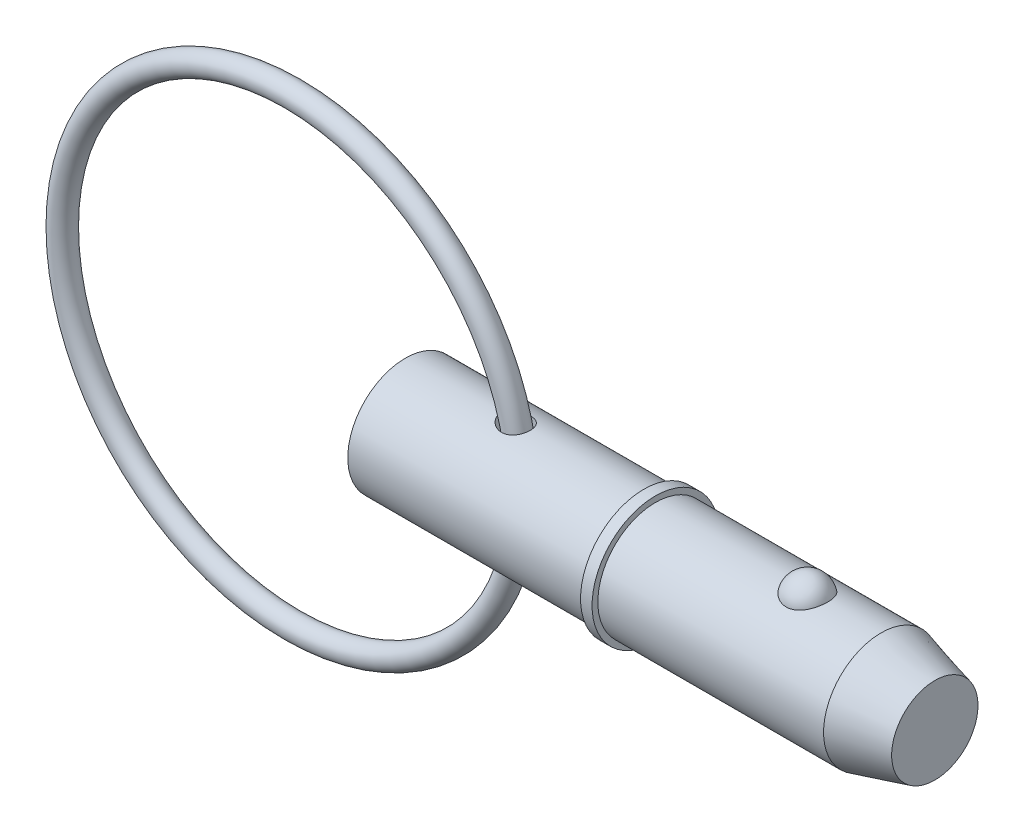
ISO-10303-21;
HEADER;
FILE_DESCRIPTION(('STEP AP214'),'2;1');
FILE_NAME('part.step','',(''),(''),'','','');
FILE_SCHEMA(('AUTOMOTIVE_DESIGN { 1 0 10303 214 1 1 1 1 }'));
ENDSEC;
DATA;
#1=APPLICATION_CONTEXT('core data for automotive mechanical design processes');
#2=APPLICATION_PROTOCOL_DEFINITION('international standard','automotive_design',2000,#1);
#3=PRODUCT_CONTEXT('',#1,'mechanical');
#4=PRODUCT('Part','Part','',(#3));
#5=PRODUCT_RELATED_PRODUCT_CATEGORY('part','',(#4));
#6=PRODUCT_DEFINITION_FORMATION('','',#4);
#7=PRODUCT_DEFINITION_CONTEXT('part definition',#1,'design');
#8=PRODUCT_DEFINITION('design','',#6,#7);
#9=PRODUCT_DEFINITION_SHAPE('','',#8);
#10=(LENGTH_UNIT() NAMED_UNIT(*) SI_UNIT(.MILLI.,.METRE.));
#11=(NAMED_UNIT(*) PLANE_ANGLE_UNIT() SI_UNIT($,.RADIAN.));
#12=(NAMED_UNIT(*) SI_UNIT($,.STERADIAN.) SOLID_ANGLE_UNIT());
#13=UNCERTAINTY_MEASURE_WITH_UNIT(LENGTH_MEASURE(1.E-05),#10,'distance_accuracy_value','');
#14=(GEOMETRIC_REPRESENTATION_CONTEXT(3) GLOBAL_UNCERTAINTY_ASSIGNED_CONTEXT((#13)) GLOBAL_UNIT_ASSIGNED_CONTEXT((#10,
#11,#12)) REPRESENTATION_CONTEXT('',''));
#15=CARTESIAN_POINT('',(0.,0.,0.));
#16=DIRECTION('',(0.,0.,1.));
#17=DIRECTION('',(1.,0.,0.));
#18=AXIS2_PLACEMENT_3D('',#15,#16,#17);
#19=CARTESIAN_POINT('',(-10.8860601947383,0.,0.));
#20=DIRECTION('',(0.,0.,1.));
#21=DIRECTION('',(1.,0.,0.));
#22=AXIS2_PLACEMENT_3D('',#19,#20,#21);
#23=TOROIDAL_SURFACE('',#22,22.225,1.111);
#24=CARTESIAN_POINT('',(12.4499398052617,0.,0.));
#25=VERTEX_POINT('',#24);
#26=VERTEX_LOOP('',#25);
#27=FACE_BOUND('',#26,.T.);
#28=ADVANCED_FACE('P0_F12',(#27),#23,.T.);
#29=CLOSED_SHELL('',(#28));
#30=MANIFOLD_SOLID_BREP('P0_B1',#29);
#31=CARTESIAN_POINT('',(0.,0.,0.));
#32=DIRECTION('',(1.,0.,0.));
#33=DIRECTION('',(0.,0.,-1.));
#34=AXIS2_PLACEMENT_3D('',#31,#32,#33);
#35=CYLINDRICAL_SURFACE('',#34,5.555);
#36=CARTESIAN_POINT('',(9.73108588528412,5.4531967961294,-1.05861687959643));
#37=CARTESIAN_POINT('',(9.79852417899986,5.4428857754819,-1.11173367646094));
#38=CARTESIAN_POINT('',(9.8705426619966,5.43287373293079,-1.15917228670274));
#39=CARTESIAN_POINT('',(10.0216706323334,5.41463354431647,-1.24159548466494));
#40=CARTESIAN_POINT('',(10.100788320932,5.40640749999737,-1.27656543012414));
#41=CARTESIAN_POINT('',(10.2640671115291,5.39277501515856,-1.33298568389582));
#42=CARTESIAN_POINT('',(10.3482338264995,5.38737178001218,-1.35442062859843));
#43=CARTESIAN_POINT('',(10.5191189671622,5.38018930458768,-1.38268153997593));
#44=CARTESIAN_POINT('',(10.6058357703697,5.37840780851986,-1.38951660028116));
#45=CARTESIAN_POINT('',(10.7759121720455,5.37883071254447,-1.38787777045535));
#46=CARTESIAN_POINT('',(10.8592768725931,5.38088957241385,-1.37996287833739));
#47=CARTESIAN_POINT('',(11.0231742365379,5.38856355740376,-1.34968531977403));
#48=CARTESIAN_POINT('',(11.1037078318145,5.39417750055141,-1.3273274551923));
#49=CARTESIAN_POINT('',(11.2542656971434,5.40784427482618,-1.27044672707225));
#50=CARTESIAN_POINT('',(11.3246325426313,5.41571997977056,-1.23678468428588));
#51=CARTESIAN_POINT('',(11.4584043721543,5.43310849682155,-1.15800564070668));
#52=CARTESIAN_POINT('',(11.5218100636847,5.4426211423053,-1.11288980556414));
#53=CARTESIAN_POINT('',(11.6387006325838,5.4619946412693,-1.01348173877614));
#54=CARTESIAN_POINT('',(11.6923567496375,5.47184490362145,-0.959388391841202));
#55=CARTESIAN_POINT('',(11.7899079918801,5.49098914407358,-0.842935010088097));
#56=CARTESIAN_POINT('',(11.8338027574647,5.50028310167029,-0.780574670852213));
#57=CARTESIAN_POINT('',(11.9111930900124,5.51740919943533,-0.64860577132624));
#58=CARTESIAN_POINT('',(11.944571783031,5.52522454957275,-0.578926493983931));
#59=CARTESIAN_POINT('',(11.9994972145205,5.53842713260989,-0.434834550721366));
#60=CARTESIAN_POINT('',(12.0210434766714,5.54381426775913,-0.360421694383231));
#61=CARTESIAN_POINT('',(12.0519313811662,5.55161917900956,-0.208311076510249));
#62=CARTESIAN_POINT('',(12.0611710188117,5.55401212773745,-0.130591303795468));
#63=CARTESIAN_POINT('',(12.0668974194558,5.55548938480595,0.0253480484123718));
#64=CARTESIAN_POINT('',(12.0633840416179,5.55457365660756,0.10356763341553));
#65=CARTESIAN_POINT('',(12.0436796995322,5.54953010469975,0.258343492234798));
#66=CARTESIAN_POINT('',(12.0274798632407,5.54540003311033,0.334898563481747));
#67=CARTESIAN_POINT('',(11.9827711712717,5.53437033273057,0.48411831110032));
#68=CARTESIAN_POINT('',(11.9542620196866,5.52747063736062,0.556782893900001));
#69=CARTESIAN_POINT('',(11.8856108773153,5.51165296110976,0.696153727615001));
#70=CARTESIAN_POINT('',(11.8454690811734,5.50273501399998,0.762860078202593));
#71=CARTESIAN_POINT('',(11.7545317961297,5.48386724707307,0.888403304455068));
#72=CARTESIAN_POINT('',(11.7037367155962,5.47391746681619,0.947240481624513));
#73=CARTESIAN_POINT('',(11.5931044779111,5.45416351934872,1.05504470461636));
#74=CARTESIAN_POINT('',(11.533318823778,5.44435885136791,1.10406448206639));
#75=CARTESIAN_POINT('',(11.4061321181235,5.42595363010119,1.19123649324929));
#76=CARTESIAN_POINT('',(11.3387321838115,5.41735290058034,1.22939031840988));
#77=CARTESIAN_POINT('',(11.1991395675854,5.4024225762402,1.29341737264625));
#78=CARTESIAN_POINT('',(11.1270175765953,5.39606585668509,1.3194385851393));
#79=CARTESIAN_POINT('',(10.979323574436,5.38614405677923,1.35937634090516));
#80=CARTESIAN_POINT('',(10.9037515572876,5.38257898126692,1.37329286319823));
#81=CARTESIAN_POINT('',(10.7507722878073,5.37854282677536,1.38901730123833));
#82=CARTESIAN_POINT('',(10.6733560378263,5.37809300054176,1.39074204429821));
#83=CARTESIAN_POINT('',(10.5192388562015,5.38029043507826,1.38221411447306));
#84=CARTESIAN_POINT('',(10.4425381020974,5.38293844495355,1.37195854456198));
#85=CARTESIAN_POINT('',(10.2878936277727,5.39116673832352,1.33926960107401));
#86=CARTESIAN_POINT('',(10.2100819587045,5.3968880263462,1.31624874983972));
#87=CARTESIAN_POINT('',(10.0591420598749,5.41064666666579,1.25849276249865));
#88=CARTESIAN_POINT('',(9.98601576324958,5.41868496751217,1.22375282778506));
#89=CARTESIAN_POINT('',(9.84175565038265,5.43675805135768,1.14087469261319));
#90=CARTESIAN_POINT('',(9.77103801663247,5.44688674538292,1.09202994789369));
#91=CARTESIAN_POINT('',(9.6388828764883,5.46759592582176,0.983100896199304));
#92=CARTESIAN_POINT('',(9.57744762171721,5.47817652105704,0.92301387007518));
#93=CARTESIAN_POINT('',(9.46620446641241,5.49850106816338,0.79298413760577));
#94=CARTESIAN_POINT('',(9.4163677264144,5.5082470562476,0.723066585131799));
#95=CARTESIAN_POINT('',(9.33050546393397,5.52566389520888,0.57497392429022));
#96=CARTESIAN_POINT('',(9.2944672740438,5.53333664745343,0.49680647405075));
#97=CARTESIAN_POINT('',(9.2410988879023,5.54491199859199,0.342579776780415));
#98=CARTESIAN_POINT('',(9.22228936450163,5.54910883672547,0.267055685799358));
#99=CARTESIAN_POINT('',(9.19883437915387,5.55436306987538,0.113748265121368));
#100=CARTESIAN_POINT('',(9.19417820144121,5.55542284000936,0.0359666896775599));
#101=CARTESIAN_POINT('',(9.19905385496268,5.55432298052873,-0.111477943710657));
#102=CARTESIAN_POINT('',(9.20724428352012,5.55246769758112,-0.181191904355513));
#103=CARTESIAN_POINT('',(9.23493000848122,5.54630180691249,-0.318223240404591));
#104=CARTESIAN_POINT('',(9.25442702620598,5.54199082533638,-0.385540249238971));
#105=CARTESIAN_POINT('',(9.30387481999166,5.5313474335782,-0.516280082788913));
#106=CARTESIAN_POINT('',(9.33386163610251,5.52500806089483,-0.579688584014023));
#107=CARTESIAN_POINT('',(9.40305503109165,5.51092599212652,-0.701037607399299));
#108=CARTESIAN_POINT('',(9.44225922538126,5.50318365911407,-0.758979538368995));
#109=CARTESIAN_POINT('',(9.52133732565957,5.48833949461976,-0.859230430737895));
#110=CARTESIAN_POINT('',(9.55998996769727,5.48134889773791,-0.90252975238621));
#111=CARTESIAN_POINT('',(9.64209346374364,5.46725903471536,-0.984288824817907));
#112=CARTESIAN_POINT('',(9.68554534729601,5.46015974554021,-1.02274753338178));
#113=CARTESIAN_POINT('',(9.73108588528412,5.4531967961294,-1.05861687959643));
#114=B_SPLINE_CURVE_WITH_KNOTS('',3,(#36,#37,#38,#39,#40,#41,#42,#43,#44,#45,#46,#47,#48,#49,
#50,#51,#52,#53,#54,#55,#56,#57,#58,#59,#60,#61,#62,#63,#64,#65,#66,#67,#68,#69,#70,#71,#72,#73,
#74,#75,#76,#77,#78,#79,#80,#81,#82,#83,#84,#85,#86,#87,#88,#89,#90,#91,#92,#93,#94,#95,#96,#97,
#98,#99,#100,#101,#102,#103,#104,#105,#106,#107,#108,#109,#110,#111,#112,#113),.UNSPECIFIED.,
.T.,.F.,(4,2,2,2,2,2,2,2,2,2,2,2,2,2,2,2,2,2,2,2,2,2,2,2,2,2,2,2,2,2,2,2,2,2,2,2,2,2,4),(0.,
0.259176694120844,0.518656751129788,0.778430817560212,1.03804303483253,1.28801585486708,
1.53790560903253,1.77195750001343,2.00598558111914,2.23539047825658,2.46480382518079,
2.69668356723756,2.9285726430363,3.16237203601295,3.39617401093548,3.63013963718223,
3.86411088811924,4.09807822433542,4.33203659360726,4.56470246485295,4.7973342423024,
5.02704913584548,5.25676442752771,5.48804534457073,5.71938220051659,5.96237360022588,
6.20546461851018,6.46387943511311,6.72235683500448,6.98018450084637,7.23777490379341,
7.47029684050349,7.70264268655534,7.91229396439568,8.12197716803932,8.33238797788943,
8.54274441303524,8.71772674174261,8.89274668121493),.UNSPECIFIED.);
#115=CARTESIAN_POINT('',(9.73108588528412,5.4531967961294,-1.05861687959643));
#116=VERTEX_POINT('',#115);
#117=EDGE_CURVE('P1_E42',#116,#116,#114,.T.);
#118=ORIENTED_EDGE('',*,*,#117,.T.);
#119=EDGE_LOOP('',(#118));
#120=FACE_BOUND('',#119,.T.);
#121=CARTESIAN_POINT('',(0.,0.,0.));
#122=DIRECTION('',(1.,0.,0.));
#123=DIRECTION('',(0.,0.,-1.));
#124=AXIS2_PLACEMENT_3D('',#121,#122,#123);
#125=CIRCLE('',#124,5.555);
#126=CARTESIAN_POINT('',(0.,0.,-5.555));
#127=VERTEX_POINT('',#126);
#128=EDGE_CURVE('P1_E9',#127,#127,#125,.T.);
#129=ORIENTED_EDGE('',*,*,#128,.T.);
#130=EDGE_LOOP('',(#129));
#131=FACE_BOUND('',#130,.T.);
#132=CARTESIAN_POINT('',(23.019,0.,0.));
#133=DIRECTION('',(1.,0.,0.));
#134=DIRECTION('',(0.,0.,-1.));
#135=AXIS2_PLACEMENT_3D('',#132,#133,#134);
#136=CIRCLE('',#135,5.555);
#137=CARTESIAN_POINT('',(23.019,0.,-5.555));
#138=VERTEX_POINT('',#137);
#139=EDGE_CURVE('P1_E25',#138,#138,#136,.T.);
#140=ORIENTED_EDGE('',*,*,#139,.F.);
#141=EDGE_LOOP('',(#140));
#142=FACE_BOUND('',#141,.T.);
#143=CARTESIAN_POINT('',(9.73108588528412,-5.4531967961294,-1.05861687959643));
#144=CARTESIAN_POINT('',(9.66821110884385,-5.46281068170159,-1.00909184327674));
#145=CARTESIAN_POINT('',(9.60927221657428,-5.47269103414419,-0.954597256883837));
#146=CARTESIAN_POINT('',(9.50103698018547,-5.49196271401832,-0.836622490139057));
#147=CARTESIAN_POINT('',(9.45174193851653,-5.50135397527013,-0.77314109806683));
#148=CARTESIAN_POINT('',(9.36449982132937,-5.51864538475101,-0.638139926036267));
#149=CARTESIAN_POINT('',(9.32660692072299,-5.52653835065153,-0.566583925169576));
#150=CARTESIAN_POINT('',(9.26443740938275,-5.53978685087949,-0.417563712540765));
#151=CARTESIAN_POINT('',(9.24015003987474,-5.54514438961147,-0.34010422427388));
#152=CARTESIAN_POINT('',(9.20806696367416,-5.55228040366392,-0.18838925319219));
#153=CARTESIAN_POINT('',(9.19907227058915,-5.55431849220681,-0.114399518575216));
#154=CARTESIAN_POINT('',(9.19432225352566,-5.55539069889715,0.0340148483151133));
#155=CARTESIAN_POINT('',(9.19856204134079,-5.55442592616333,0.108439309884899));
#156=CARTESIAN_POINT('',(9.21926816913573,-5.54978420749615,0.250226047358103));
#157=CARTESIAN_POINT('',(9.2348766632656,-5.54629766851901,0.31772275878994));
#158=CARTESIAN_POINT('',(9.27656619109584,-5.53719805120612,0.449233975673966));
#159=CARTESIAN_POINT('',(9.3026486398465,-5.53158468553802,0.513248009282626));
#160=CARTESIAN_POINT('',(9.36540111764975,-5.51852259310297,0.63880901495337));
#161=CARTESIAN_POINT('',(9.40244578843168,-5.51101059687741,0.700161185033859));
#162=CARTESIAN_POINT('',(9.48531033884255,-5.49498546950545,0.816463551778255));
#163=CARTESIAN_POINT('',(9.5311337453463,-5.48647193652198,0.871411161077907));
#164=CARTESIAN_POINT('',(9.63549825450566,-5.46826315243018,0.979510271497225));
#165=CARTESIAN_POINT('',(9.69487291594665,-5.4585383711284,1.03185240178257));
#166=CARTESIAN_POINT('',(9.82107706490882,-5.43973797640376,1.12677509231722));
#167=CARTESIAN_POINT('',(9.8879103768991,-5.43066269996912,1.16935061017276));
#168=CARTESIAN_POINT('',(10.033391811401,-5.41336505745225,1.24708757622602));
#169=CARTESIAN_POINT('',(10.1125613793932,-5.40528106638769,1.28130933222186));
#170=CARTESIAN_POINT('',(10.2757060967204,-5.39196874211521,1.3362270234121));
#171=CARTESIAN_POINT('',(10.3596813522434,-5.38674047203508,1.35692265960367));
#172=CARTESIAN_POINT('',(10.5297702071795,-5.37991196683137,1.38375156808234));
#173=CARTESIAN_POINT('',(10.6158742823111,-5.37829778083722,1.38994084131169));
#174=CARTESIAN_POINT('',(10.7878226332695,-5.3790107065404,1.38718250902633));
#175=CARTESIAN_POINT('',(10.8736670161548,-5.38133587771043,1.37824235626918));
#176=CARTESIAN_POINT('',(11.0366214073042,-5.38945418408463,1.34612618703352));
#177=CARTESIAN_POINT('',(11.1139351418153,-5.39501006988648,1.32392147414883));
#178=CARTESIAN_POINT('',(11.2633246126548,-5.40877222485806,1.26652021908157));
#179=CARTESIAN_POINT('',(11.3354015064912,-5.4169779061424,1.23132655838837));
#180=CARTESIAN_POINT('',(11.4690899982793,-5.43466078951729,1.15069817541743));
#181=CARTESIAN_POINT('',(11.5310200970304,-5.4440673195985,1.10577441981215));
#182=CARTESIAN_POINT('',(11.6463540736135,-5.46335537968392,1.0061512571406));
#183=CARTESIAN_POINT('',(11.6997580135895,-5.47323690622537,0.951451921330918));
#184=CARTESIAN_POINT('',(11.7967319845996,-5.49239864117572,0.833747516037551));
#185=CARTESIAN_POINT('',(11.8402908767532,-5.50167816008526,0.770733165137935));
#186=CARTESIAN_POINT('',(11.9164538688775,-5.518621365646,0.638202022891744));
#187=CARTESIAN_POINT('',(11.9490573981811,-5.52628496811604,0.568684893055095));
#188=CARTESIAN_POINT('',(12.0028717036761,-5.53925911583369,0.424207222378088));
#189=CARTESIAN_POINT('',(12.023941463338,-5.54454040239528,0.349191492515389));
#190=CARTESIAN_POINT('',(12.053591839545,-5.55204602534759,0.196582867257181));
#191=CARTESIAN_POINT('',(12.0621722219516,-5.55427030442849,0.118989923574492));
#192=CARTESIAN_POINT('',(12.0666512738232,-5.55542602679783,-0.0368468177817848));
#193=CARTESIAN_POINT('',(12.0625074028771,-5.55434642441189,-0.115091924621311));
#194=CARTESIAN_POINT('',(12.0415418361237,-5.54898613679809,-0.269753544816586));
#195=CARTESIAN_POINT('',(12.0247199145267,-5.54470539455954,-0.346170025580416));
#196=CARTESIAN_POINT('',(11.9787920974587,-5.53340452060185,-0.495008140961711));
#197=CARTESIAN_POINT('',(11.9496857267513,-5.52638428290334,-0.56742962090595));
#198=CARTESIAN_POINT('',(11.8798787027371,-5.51036911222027,-0.706216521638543));
#199=CARTESIAN_POINT('',(11.8391779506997,-5.50137416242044,-0.772581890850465));
#200=CARTESIAN_POINT('',(11.7472553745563,-5.48242167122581,-0.89724716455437));
#201=CARTESIAN_POINT('',(11.6960515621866,-5.47246579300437,-0.955560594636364));
#202=CARTESIAN_POINT('',(11.5843994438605,-5.45270071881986,-1.06256643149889));
#203=CARTESIAN_POINT('',(11.5239521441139,-5.44289150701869,-1.11125988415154));
#204=CARTESIAN_POINT('',(11.396157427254,-5.42463941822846,-1.19717500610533));
#205=CARTESIAN_POINT('',(11.3288903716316,-5.41618309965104,-1.23451335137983));
#206=CARTESIAN_POINT('',(11.1888557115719,-5.40145691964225,-1.29743539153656));
#207=CARTESIAN_POINT('',(11.1160887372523,-5.39518680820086,-1.32302043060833));
#208=CARTESIAN_POINT('',(10.9677009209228,-5.38553131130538,-1.36179181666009));
#209=CARTESIAN_POINT('',(10.8921036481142,-5.3821260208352,-1.3750637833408));
#210=CARTESIAN_POINT('',(10.7396925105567,-5.37842027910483,-1.38948741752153));
#211=CARTESIAN_POINT('',(10.6628784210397,-5.37812040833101,-1.39063681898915));
#212=CARTESIAN_POINT('',(10.5077947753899,-5.38059635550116,-1.38102577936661));
#213=CARTESIAN_POINT('',(10.4295489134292,-5.3834629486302,-1.36991384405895));
#214=CARTESIAN_POINT('',(10.2758428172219,-5.3920092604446,-1.33587599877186));
#215=CARTESIAN_POINT('',(10.2003829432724,-5.39768934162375,-1.3129485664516));
#216=CARTESIAN_POINT('',(10.0559381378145,-5.41102817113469,-1.25682313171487));
#217=CARTESIAN_POINT('',(9.98683368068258,-5.41862962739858,-1.22391777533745));
#218=CARTESIAN_POINT('',(9.85432617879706,-5.43513913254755,-1.14838146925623));
#219=CARTESIAN_POINT('',(9.79092361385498,-5.44404729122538,-1.1057497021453));
#220=CARTESIAN_POINT('',(9.73108588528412,-5.4531967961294,-1.05861687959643));
#221=B_SPLINE_CURVE_WITH_KNOTS('',3,(#143,#144,#145,#146,#147,#148,#149,#150,#151,#152,#153,
#154,#155,#156,#157,#158,#159,#160,#161,#162,#163,#164,#165,#166,#167,#168,#169,#170,#171,#172,
#173,#174,#175,#176,#177,#178,#179,#180,#181,#182,#183,#184,#185,#186,#187,#188,#189,#190,#191,
#192,#193,#194,#195,#196,#197,#198,#199,#200,#201,#202,#203,#204,#205,#206,#207,#208,#209,#210,
#211,#212,#213,#214,#215,#216,#217,#218,#219,#220),.UNSPECIFIED.,.T.,.F.,(4,2,2,2,2,2,2,2,2,2,2,
2,2,2,2,2,2,2,2,2,2,2,2,2,2,2,2,2,2,2,2,2,2,2,2,2,2,2,4),(0.,0.241596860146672,
0.483226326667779,0.725986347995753,0.968554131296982,1.19103755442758,1.41343881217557,
1.62059806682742,1.82778531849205,2.04308674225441,2.25847484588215,2.4967195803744,
2.73508704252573,2.99374644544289,3.25241156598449,3.51007646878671,3.76761448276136,
4.00827541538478,4.24888299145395,4.47904430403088,4.70920393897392,4.93962269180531,
5.17005344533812,5.4032419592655,5.63643484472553,5.87040820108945,6.10438572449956,
6.33837230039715,6.57236086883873,6.80595147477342,7.03951667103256,7.27059385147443,
7.50164459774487,7.73107640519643,7.96055109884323,8.19677907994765,8.43303750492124,
8.66294515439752,8.8928721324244),.UNSPECIFIED.);
#222=CARTESIAN_POINT('',(9.73108588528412,-5.4531967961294,-1.05861687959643));
#223=VERTEX_POINT('',#222);
#224=EDGE_CURVE('P1_E17',#223,#223,#221,.T.);
#225=ORIENTED_EDGE('',*,*,#224,.T.);
#226=EDGE_LOOP('',(#225));
#227=FACE_BOUND('',#226,.T.);
#228=ADVANCED_FACE('P1_F13',(#120,#131,#142,#227),#35,.T.);
#229=CARTESIAN_POINT('',(0.,0.,0.));
#230=DIRECTION('',(1.,0.,0.));
#231=DIRECTION('',(0.,0.,-1.));
#232=AXIS2_PLACEMENT_3D('',#229,#230,#231);
#233=CYLINDRICAL_SURFACE('',#232,5.555);
#234=CARTESIAN_POINT('',(45.9171144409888,0.,0.));
#235=DIRECTION('',(1.,0.,0.));
#236=DIRECTION('',(0.,0.,-1.));
#237=AXIS2_PLACEMENT_3D('',#234,#235,#236);
#238=CIRCLE('',#237,5.555);
#239=CARTESIAN_POINT('',(45.9171144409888,0.,-5.555));
#240=VERTEX_POINT('',#239);
#241=EDGE_CURVE('P1_E99',#240,#240,#238,.T.);
#242=ORIENTED_EDGE('',*,*,#241,.F.);
#243=EDGE_LOOP('',(#242));
#244=FACE_BOUND('',#243,.T.);
#245=CARTESIAN_POINT('',(24.13,0.,0.));
#246=DIRECTION('',(1.,0.,0.));
#247=DIRECTION('',(0.,0.,-1.));
#248=AXIS2_PLACEMENT_3D('',#245,#246,#247);
#249=CIRCLE('',#248,5.555);
#250=CARTESIAN_POINT('',(24.13,0.,-5.555));
#251=VERTEX_POINT('',#250);
#252=EDGE_CURVE('P1_E96',#251,#251,#249,.T.);
#253=ORIENTED_EDGE('',*,*,#252,.T.);
#254=EDGE_LOOP('',(#253));
#255=FACE_BOUND('',#254,.T.);
#256=CARTESIAN_POINT('',(38.7986264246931,5.16741224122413,2.03859650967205));
#257=CARTESIAN_POINT('',(38.6929492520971,5.16740893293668,2.03859990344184));
#258=CARTESIAN_POINT('',(38.58729894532,5.17079470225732,2.03008306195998));
#259=CARTESIAN_POINT('',(38.3791419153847,5.18392795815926,1.9963072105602));
#260=CARTESIAN_POINT('',(38.2766344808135,5.19367399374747,1.9710520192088));
#261=CARTESIAN_POINT('',(38.0777710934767,5.21839168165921,1.90463997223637));
#262=CARTESIAN_POINT('',(37.9814064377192,5.23335573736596,1.86350622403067));
#263=CARTESIAN_POINT('',(37.7970804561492,5.26688076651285,1.76652592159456));
#264=CARTESIAN_POINT('',(37.7091207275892,5.28544242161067,1.71067657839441));
#265=CARTESIAN_POINT('',(37.5412654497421,5.32479845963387,1.58399959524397));
#266=CARTESIAN_POINT('',(37.4616656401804,5.34564089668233,1.51279545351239));
#267=CARTESIAN_POINT('',(37.3151290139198,5.38697258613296,1.35828584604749));
#268=CARTESIAN_POINT('',(37.248194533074,5.40746177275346,1.27497815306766));
#269=CARTESIAN_POINT('',(37.1256103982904,5.44694508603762,1.09440293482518));
#270=CARTESIAN_POINT('',(37.0705989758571,5.46583143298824,0.99667783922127));
#271=CARTESIAN_POINT('',(36.9769376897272,5.49908030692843,0.792961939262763));
#272=CARTESIAN_POINT('',(36.9382894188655,5.513442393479,0.686970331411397));
#273=CARTESIAN_POINT('',(36.8776807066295,5.536358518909,0.468019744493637));
#274=CARTESIAN_POINT('',(36.8559725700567,5.54482455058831,0.35498154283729));
#275=CARTESIAN_POINT('',(36.8306362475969,5.55473324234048,0.126595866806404));
#276=CARTESIAN_POINT('',(36.8270077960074,5.55617600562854,0.0112484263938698));
#277=CARTESIAN_POINT('',(36.8378817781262,5.55189984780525,-0.21801161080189));
#278=CARTESIAN_POINT('',(36.8523151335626,5.54620821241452,-0.331928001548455));
#279=CARTESIAN_POINT('',(36.8989034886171,5.52828920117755,-0.555544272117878));
#280=CARTESIAN_POINT('',(36.9310588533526,5.51606169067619,-0.665244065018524));
#281=CARTESIAN_POINT('',(37.0124883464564,5.48630779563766,-0.877469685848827));
#282=CARTESIAN_POINT('',(37.0617816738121,5.4687754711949,-0.979987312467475));
#283=CARTESIAN_POINT('',(37.1764785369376,5.43024700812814,-1.1748697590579));
#284=CARTESIAN_POINT('',(37.2418831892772,5.4092506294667,-1.26723387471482));
#285=CARTESIAN_POINT('',(37.3875712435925,5.36600927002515,-1.4394013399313));
#286=CARTESIAN_POINT('',(37.4678859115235,5.34376173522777,-1.51917763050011));
#287=CARTESIAN_POINT('',(37.6414520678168,5.30057971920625,-1.6636033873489));
#288=CARTESIAN_POINT('',(37.734702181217,5.27964509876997,-1.72825445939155));
#289=CARTESIAN_POINT('',(37.9293939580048,5.24205250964,-1.8390947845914));
#290=CARTESIAN_POINT('',(38.0305900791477,5.22530519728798,-1.88568407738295));
#291=CARTESIAN_POINT('',(38.2401552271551,5.19750919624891,-1.96100802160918));
#292=CARTESIAN_POINT('',(38.3485215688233,5.1864583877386,-1.98974931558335));
#293=CARTESIAN_POINT('',(38.5634989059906,5.17184410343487,-2.02742262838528));
#294=CARTESIAN_POINT('',(38.669925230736,5.16793282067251,-2.0372760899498));
#295=CARTESIAN_POINT('',(38.8829925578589,5.1669899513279,-2.03966777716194));
#296=CARTESIAN_POINT('',(38.9896335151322,5.16995704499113,-2.03220932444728));
#297=CARTESIAN_POINT('',(39.1967730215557,5.18222383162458,-2.0007117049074));
#298=CARTESIAN_POINT('',(39.2973599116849,5.19133213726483,-1.97717337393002));
#299=CARTESIAN_POINT('',(39.4930141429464,5.21467637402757,-1.91475248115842));
#300=CARTESIAN_POINT('',(39.5880810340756,5.22891272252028,-1.87586867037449));
#301=CARTESIAN_POINT('',(39.7723711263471,5.26137066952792,-1.78282713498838));
#302=CARTESIAN_POINT('',(39.8614190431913,5.27967329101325,-1.7283512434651));
#303=CARTESIAN_POINT('',(40.0292880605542,5.31817411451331,-1.60597483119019));
#304=CARTESIAN_POINT('',(40.1081068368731,5.33837274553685,-1.53807126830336));
#305=CARTESIAN_POINT('',(40.2575156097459,5.37968287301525,-1.38688970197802));
#306=CARTESIAN_POINT('',(40.3275058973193,5.40079011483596,-1.30301744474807));
#307=CARTESIAN_POINT('',(40.4530125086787,5.44074401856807,-1.12458170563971));
#308=CARTESIAN_POINT('',(40.5085262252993,5.4595902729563,-1.03001630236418));
#309=CARTESIAN_POINT('',(40.6055507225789,5.49369849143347,-0.829439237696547));
#310=CARTESIAN_POINT('',(40.6465483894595,5.50882422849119,-0.723155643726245));
#311=CARTESIAN_POINT('',(40.7111250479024,5.53310911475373,-0.504772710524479));
#312=CARTESIAN_POINT('',(40.7347036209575,5.54226812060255,-0.392673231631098));
#313=CARTESIAN_POINT('',(40.764013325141,5.55370358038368,-0.165459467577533));
#314=CARTESIAN_POINT('',(40.7696884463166,5.55595843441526,-0.0503368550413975));
#315=CARTESIAN_POINT('',(40.762916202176,5.55329317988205,0.179288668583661));
#316=CARTESIAN_POINT('',(40.7504690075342,5.54837313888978,0.293791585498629));
#317=CARTESIAN_POINT('',(40.7077798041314,5.53189037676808,0.518526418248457));
#318=CARTESIAN_POINT('',(40.677598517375,5.5203503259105,0.628771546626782));
#319=CARTESIAN_POINT('',(40.6000962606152,5.49182453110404,0.842318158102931));
#320=CARTESIAN_POINT('',(40.5527743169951,5.47483847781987,0.945619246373));
#321=CARTESIAN_POINT('',(40.4417204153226,5.43710633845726,1.14281571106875));
#322=CARTESIAN_POINT('',(40.377921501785,5.41634501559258,1.23667048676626));
#323=CARTESIAN_POINT('',(40.2353577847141,5.37334572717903,1.41185243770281));
#324=CARTESIAN_POINT('',(40.1565932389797,5.35110778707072,1.49317982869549));
#325=CARTESIAN_POINT('',(39.9864234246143,5.30779474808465,1.64049162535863));
#326=CARTESIAN_POINT('',(39.8951002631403,5.28671324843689,1.7065687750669));
#327=CARTESIAN_POINT('',(39.7017390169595,5.24804852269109,1.82201372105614));
#328=CARTESIAN_POINT('',(39.5997005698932,5.23046541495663,1.87138095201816));
#329=CARTESIAN_POINT('',(39.3836187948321,5.20042692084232,1.95335298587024));
#330=CARTESIAN_POINT('',(39.2692602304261,5.18820192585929,1.98521734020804));
#331=CARTESIAN_POINT('',(39.0361307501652,5.17169804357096,2.02783294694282));
#332=CARTESIAN_POINT('',(38.9173616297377,5.16741595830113,2.03859269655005));
#333=CARTESIAN_POINT('',(38.7986264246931,5.16741224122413,2.03859650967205));
#334=B_SPLINE_CURVE_WITH_KNOTS('',3,(#256,#257,#258,#259,#260,#261,#262,#263,#264,#265,#266,
#267,#268,#269,#270,#271,#272,#273,#274,#275,#276,#277,#278,#279,#280,#281,#282,#283,#284,#285,
#286,#287,#288,#289,#290,#291,#292,#293,#294,#295,#296,#297,#298,#299,#300,#301,#302,#303,#304,
#305,#306,#307,#308,#309,#310,#311,#312,#313,#314,#315,#316,#317,#318,#319,#320,#321,#322,#323,
#324,#325,#326,#327,#328,#329,#330,#331,#332,#333),.UNSPECIFIED.,.T.,.F.,(4,2,2,2,2,2,2,2,2,2,2,
2,2,2,2,2,2,2,2,2,2,2,2,2,2,2,2,2,2,2,2,2,2,2,2,2,2,2,4),(0.,0.316595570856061,
0.633118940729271,0.949183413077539,1.26530783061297,1.59030762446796,1.91536729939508,
2.25495824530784,2.59458224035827,2.93917283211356,3.28375835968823,3.62703002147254,
3.97030875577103,4.31397329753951,4.65766166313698,5.00207904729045,5.34645984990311,
5.6827054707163,6.0188258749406,6.33808403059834,6.65728093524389,6.9669637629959,
7.27667180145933,7.59321535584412,7.90983070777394,8.24210387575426,8.57443684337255,
8.91755896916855,9.26068933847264,9.60489211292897,9.94909164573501,10.2921194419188,
10.6351667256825,10.9796305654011,11.324088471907,11.666392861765,12.0087088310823,
12.3645679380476,12.7202837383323),.UNSPECIFIED.);
#335=CARTESIAN_POINT('',(38.7986264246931,5.16741224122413,2.03859650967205));
#336=VERTEX_POINT('',#335);
#337=EDGE_CURVE('P1_E34',#336,#336,#334,.T.);
#338=ORIENTED_EDGE('',*,*,#337,.T.);
#339=EDGE_LOOP('',(#338));
#340=FACE_BOUND('',#339,.T.);
#341=ADVANCED_FACE('P1_F46',(#244,#255,#340),#233,.T.);
#342=CARTESIAN_POINT('',(0.,0.,0.));
#343=DIRECTION('',(-1.,0.,0.));
#344=DIRECTION('',(0.,0.,1.));
#345=AXIS2_PLACEMENT_3D('',#342,#343,#344);
#346=PLANE('',#345);
#347=ORIENTED_EDGE('',*,*,#128,.F.);
#348=EDGE_LOOP('',(#347));
#349=FACE_BOUND('',#348,.T.);
#350=ADVANCED_FACE('P1_F15',(#349),#346,.T.);
#351=CARTESIAN_POINT('',(23.019,5.555,0.));
#352=DIRECTION('',(-1.,0.,0.));
#353=DIRECTION('',(0.,0.,1.));
#354=AXIS2_PLACEMENT_3D('',#351,#352,#353);
#355=PLANE('',#354);
#356=ORIENTED_EDGE('',*,*,#139,.T.);
#357=EDGE_LOOP('',(#356));
#358=FACE_BOUND('',#357,.T.);
#359=CARTESIAN_POINT('',(23.019,0.,0.));
#360=DIRECTION('',(1.,0.,0.));
#361=DIRECTION('',(0.,0.,-1.));
#362=AXIS2_PLACEMENT_3D('',#359,#360,#361);
#363=CIRCLE('',#362,6.1105);
#364=CARTESIAN_POINT('',(23.019,0.,-6.1105));
#365=VERTEX_POINT('',#364);
#366=EDGE_CURVE('P1_E30',#365,#365,#363,.T.);
#367=ORIENTED_EDGE('',*,*,#366,.F.);
#368=EDGE_LOOP('',(#367));
#369=FACE_BOUND('',#368,.T.);
#370=ADVANCED_FACE('P1_F81',(#358,#369),#355,.T.);
#371=CARTESIAN_POINT('',(0.,0.,0.));
#372=DIRECTION('',(1.,0.,0.));
#373=DIRECTION('',(0.,0.,-1.));
#374=AXIS2_PLACEMENT_3D('',#371,#372,#373);
#375=CYLINDRICAL_SURFACE('',#374,6.1105);
#376=ORIENTED_EDGE('',*,*,#366,.T.);
#377=EDGE_LOOP('',(#376));
#378=FACE_BOUND('',#377,.T.);
#379=CARTESIAN_POINT('',(24.13,0.,0.));
#380=DIRECTION('',(1.,0.,0.));
#381=DIRECTION('',(0.,0.,-1.));
#382=AXIS2_PLACEMENT_3D('',#379,#380,#381);
#383=CIRCLE('',#382,6.1105);
#384=CARTESIAN_POINT('',(24.13,0.,-6.1105));
#385=VERTEX_POINT('',#384);
#386=EDGE_CURVE('P1_E95',#385,#385,#383,.T.);
#387=ORIENTED_EDGE('',*,*,#386,.F.);
#388=EDGE_LOOP('',(#387));
#389=FACE_BOUND('',#388,.T.);
#390=ADVANCED_FACE('P1_F68',(#378,#389),#375,.T.);
#391=CARTESIAN_POINT('',(24.13,6.1105,0.));
#392=DIRECTION('',(1.,0.,0.));
#393=DIRECTION('',(0.,0.,-1.));
#394=AXIS2_PLACEMENT_3D('',#391,#392,#393);
#395=PLANE('',#394);
#396=ORIENTED_EDGE('',*,*,#386,.T.);
#397=EDGE_LOOP('',(#396));
#398=FACE_BOUND('',#397,.T.);
#399=ORIENTED_EDGE('',*,*,#252,.F.);
#400=EDGE_LOOP('',(#399));
#401=FACE_BOUND('',#400,.T.);
#402=ADVANCED_FACE('P1_F62',(#398,#401),#395,.T.);
#403=CARTESIAN_POINT('',(51.1,0.,0.));
#404=DIRECTION('',(-1.,0.,0.));
#405=DIRECTION('',(0.,0.,1.));
#406=AXIS2_PLACEMENT_3D('',#403,#404,#405);
#407=CONICAL_SURFACE('',#406,4.16625000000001,0.26179938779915);
#408=ORIENTED_EDGE('',*,*,#241,.T.);
#409=EDGE_LOOP('',(#408));
#410=FACE_BOUND('',#409,.T.);
#411=CARTESIAN_POINT('',(51.1,0.,0.));
#412=DIRECTION('',(1.,0.,0.));
#413=DIRECTION('',(0.,0.,-1.));
#414=AXIS2_PLACEMENT_3D('',#411,#412,#413);
#415=CIRCLE('',#414,4.16625000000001);
#416=CARTESIAN_POINT('',(51.1,0.,-4.16625000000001));
#417=VERTEX_POINT('',#416);
#418=EDGE_CURVE('P1_E41',#417,#417,#415,.T.);
#419=ORIENTED_EDGE('',*,*,#418,.F.);
#420=EDGE_LOOP('',(#419));
#421=FACE_BOUND('',#420,.T.);
#422=ADVANCED_FACE('P1_F59',(#410,#421),#407,.T.);
#423=CARTESIAN_POINT('',(51.1,4.16625000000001,0.));
#424=DIRECTION('',(1.,0.,0.));
#425=DIRECTION('',(0.,0.,-1.));
#426=AXIS2_PLACEMENT_3D('',#423,#424,#425);
#427=PLANE('',#426);
#428=ORIENTED_EDGE('',*,*,#418,.T.);
#429=EDGE_LOOP('',(#428));
#430=FACE_BOUND('',#429,.T.);
#431=ADVANCED_FACE('P1_F55',(#430),#427,.T.);
#432=CARTESIAN_POINT('',(38.7986264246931,4.9995,0.));
#433=DIRECTION('',(-1.,0.,0.));
#434=DIRECTION('',(0.,1.,0.));
#435=AXIS2_PLACEMENT_3D('',#432,#433,#434);
#436=SPHERICAL_SURFACE('',#435,2.04549999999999);
#437=ORIENTED_EDGE('',*,*,#337,.F.);
#438=EDGE_LOOP('',(#437));
#439=FACE_BOUND('',#438,.T.);
#440=ADVANCED_FACE('P1_F50',(#439),#436,.T.);
#441=CARTESIAN_POINT('',(-10.8860601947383,0.,0.));
#442=DIRECTION('',(0.,0.,1.));
#443=DIRECTION('',(1.,0.,0.));
#444=AXIS2_PLACEMENT_3D('',#441,#442,#443);
#445=TOROIDAL_SURFACE('',#444,22.225,1.38875);
#446=ORIENTED_EDGE('',*,*,#224,.F.);
#447=EDGE_LOOP('',(#446));
#448=FACE_BOUND('',#447,.T.);
#449=ORIENTED_EDGE('',*,*,#117,.F.);
#450=EDGE_LOOP('',(#449));
#451=FACE_BOUND('',#450,.T.);
#452=ADVANCED_FACE('P1_F54',(#448,#451),#445,.F.);
#453=CLOSED_SHELL('',(#228,#341,#350,#370,#390,#402,#422,#431,#440,#452));
#454=MANIFOLD_SOLID_BREP('P1_B1',#453);
#455=ADVANCED_BREP_SHAPE_REPRESENTATION('',(#18,#30,#454),#14);
#456=SHAPE_DEFINITION_REPRESENTATION(#9,#455);
ENDSEC;
END-ISO-10303-21;
